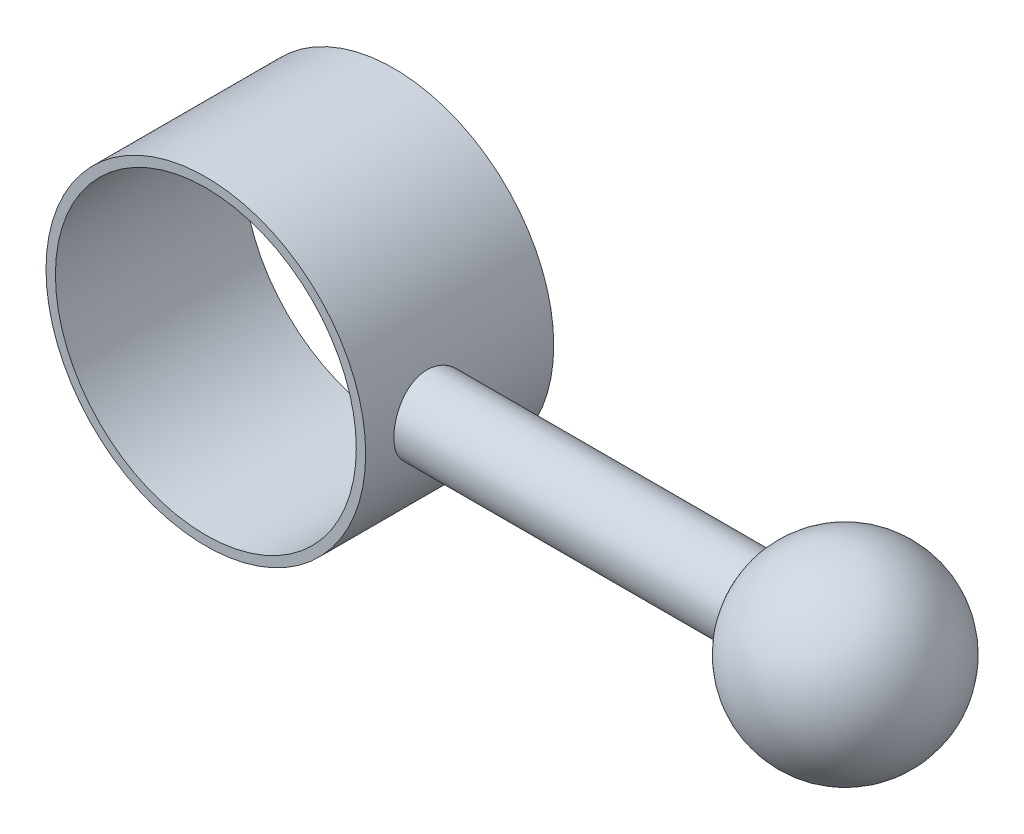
ISO-10303-21;
HEADER;
FILE_DESCRIPTION(('STEP AP214'),'2;1');
FILE_NAME('part.step','',(''),(''),'','','');
FILE_SCHEMA(('AUTOMOTIVE_DESIGN { 1 0 10303 214 1 1 1 1 }'));
ENDSEC;
DATA;
#1=APPLICATION_CONTEXT('core data for automotive mechanical design processes');
#2=APPLICATION_PROTOCOL_DEFINITION('international standard','automotive_design',2000,#1);
#3=PRODUCT_CONTEXT('',#1,'mechanical');
#4=PRODUCT('Part','Part','',(#3));
#5=PRODUCT_RELATED_PRODUCT_CATEGORY('part','',(#4));
#6=PRODUCT_DEFINITION_FORMATION('','',#4);
#7=PRODUCT_DEFINITION_CONTEXT('part definition',#1,'design');
#8=PRODUCT_DEFINITION('design','',#6,#7);
#9=PRODUCT_DEFINITION_SHAPE('','',#8);
#10=(LENGTH_UNIT() NAMED_UNIT(*) SI_UNIT(.MILLI.,.METRE.));
#11=(NAMED_UNIT(*) PLANE_ANGLE_UNIT() SI_UNIT($,.RADIAN.));
#12=(NAMED_UNIT(*) SI_UNIT($,.STERADIAN.) SOLID_ANGLE_UNIT());
#13=UNCERTAINTY_MEASURE_WITH_UNIT(LENGTH_MEASURE(1.E-05),#10,'distance_accuracy_value','');
#14=(GEOMETRIC_REPRESENTATION_CONTEXT(3) GLOBAL_UNCERTAINTY_ASSIGNED_CONTEXT((#13)) GLOBAL_UNIT_ASSIGNED_CONTEXT((#10,
#11,#12)) REPRESENTATION_CONTEXT('',''));
#15=CARTESIAN_POINT('',(0.,0.,0.));
#16=DIRECTION('',(0.,0.,1.));
#17=DIRECTION('',(1.,0.,0.));
#18=AXIS2_PLACEMENT_3D('',#15,#16,#17);
#19=CARTESIAN_POINT('',(0.,0.,0.));
#20=DIRECTION('',(0.,0.,-1.));
#21=DIRECTION('',(1.,0.,0.));
#22=AXIS2_PLACEMENT_3D('',#19,#20,#21);
#23=PLANE('',#22);
#24=CARTESIAN_POINT('',(0.,0.,0.));
#25=DIRECTION('',(0.,0.,-1.));
#26=DIRECTION('',(1.,0.,0.));
#27=AXIS2_PLACEMENT_3D('',#24,#25,#26);
#28=CIRCLE('',#27,17.);
#29=CARTESIAN_POINT('',(17.,0.,0.));
#30=VERTEX_POINT('',#29);
#31=EDGE_CURVE('E17',#30,#30,#28,.T.);
#32=ORIENTED_EDGE('',*,*,#31,.T.);
#33=EDGE_LOOP('',(#32));
#34=FACE_BOUND('',#33,.T.);
#35=CARTESIAN_POINT('',(0.,0.,0.));
#36=DIRECTION('',(0.,0.,-1.));
#37=DIRECTION('',(1.,0.,0.));
#38=AXIS2_PLACEMENT_3D('',#35,#36,#37);
#39=CIRCLE('',#38,16.);
#40=CARTESIAN_POINT('',(16.,0.,0.));
#41=VERTEX_POINT('',#40);
#42=EDGE_CURVE('E64',#41,#41,#39,.T.);
#43=ORIENTED_EDGE('',*,*,#42,.F.);
#44=EDGE_LOOP('',(#43));
#45=FACE_BOUND('',#44,.T.);
#46=ADVANCED_FACE('F12',(#34,#45),#23,.T.);
#47=CARTESIAN_POINT('',(0.,0.,0.));
#48=DIRECTION('',(0.,0.,1.));
#49=DIRECTION('',(-1.,0.,0.));
#50=AXIS2_PLACEMENT_3D('',#47,#48,#49);
#51=CYLINDRICAL_SURFACE('',#50,17.);
#52=CARTESIAN_POINT('',(0.,0.,20.));
#53=DIRECTION('',(0.,0.,-1.));
#54=DIRECTION('',(1.,0.,0.));
#55=AXIS2_PLACEMENT_3D('',#52,#53,#54);
#56=CIRCLE('',#55,17.);
#57=CARTESIAN_POINT('',(17.,0.,20.));
#58=VERTEX_POINT('',#57);
#59=EDGE_CURVE('E25',#58,#58,#56,.T.);
#60=ORIENTED_EDGE('',*,*,#59,.T.);
#61=EDGE_LOOP('',(#60));
#62=FACE_BOUND('',#61,.T.);
#63=ORIENTED_EDGE('',*,*,#31,.F.);
#64=EDGE_LOOP('',(#63));
#65=FACE_BOUND('',#64,.T.);
#66=CARTESIAN_POINT('',(16.9999999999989,5.83635432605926E-06,9.));
#67=CARTESIAN_POINT('',(16.9999959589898,0.221420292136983,9.00000691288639));
#68=CARTESIAN_POINT('',(16.9956306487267,0.442914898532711,9.01844610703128));
#69=CARTESIAN_POINT('',(16.9786390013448,0.879583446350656,9.09162175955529));
#70=CARTESIAN_POINT('',(16.9660073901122,1.09475326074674,9.14638139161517));
#71=CARTESIAN_POINT('',(16.9338856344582,1.5124009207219,9.29036481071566));
#72=CARTESIAN_POINT('',(16.9144032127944,1.71489275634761,9.37954980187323));
#73=CARTESIAN_POINT('',(16.870668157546,2.10203696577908,9.589722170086));
#74=CARTESIAN_POINT('',(16.8464154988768,2.28668924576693,9.71070971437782));
#75=CARTESIAN_POINT('',(16.7952856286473,2.63631339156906,9.98340628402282));
#76=CARTESIAN_POINT('',(16.7683717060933,2.80091013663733,10.1355894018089));
#77=CARTESIAN_POINT('',(16.7152036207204,3.10249425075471,10.4653408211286));
#78=CARTESIAN_POINT('',(16.688949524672,3.23947883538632,10.6429116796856));
#79=CARTESIAN_POINT('',(16.6397077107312,3.48366111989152,11.0212430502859));
#80=CARTESIAN_POINT('',(16.6167668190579,3.59044906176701,11.2222746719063));
#81=CARTESIAN_POINT('',(16.5772803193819,3.76857496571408,11.6400610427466));
#82=CARTESIAN_POINT('',(16.5607338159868,3.83991789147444,11.8568135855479));
#83=CARTESIAN_POINT('',(16.536285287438,3.94386822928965,12.2957904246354));
#84=CARTESIAN_POINT('',(16.5282340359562,3.97714521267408,12.5178476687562));
#85=CARTESIAN_POINT('',(16.5212402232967,4.0061029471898,12.9645277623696));
#86=CARTESIAN_POINT('',(16.5222963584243,4.00178907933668,13.1891502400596));
#87=CARTESIAN_POINT('',(16.5332633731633,3.95622401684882,13.6295288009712));
#88=CARTESIAN_POINT('',(16.5429853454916,3.91576080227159,13.845371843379));
#89=CARTESIAN_POINT('',(16.5698887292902,3.80029846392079,14.2671171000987));
#90=CARTESIAN_POINT('',(16.5870706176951,3.72529713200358,14.4730186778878));
#91=CARTESIAN_POINT('',(16.6271374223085,3.54219102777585,14.8711986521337));
#92=CARTESIAN_POINT('',(16.65007267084,3.43379206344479,15.0633364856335));
#93=CARTESIAN_POINT('',(16.6990323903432,3.18717400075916,15.4269823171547));
#94=CARTESIAN_POINT('',(16.7250573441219,3.04895023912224,15.5984870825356));
#95=CARTESIAN_POINT('',(16.7780669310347,2.74248101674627,15.9205245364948));
#96=CARTESIAN_POINT('',(16.8050592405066,2.57356805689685,16.0704214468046));
#97=CARTESIAN_POINT('',(16.8563692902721,2.21268614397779,16.3398735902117));
#98=CARTESIAN_POINT('',(16.8806869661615,2.02071663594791,16.4594280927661));
#99=CARTESIAN_POINT('',(16.924007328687,1.6183276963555,16.6649976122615));
#100=CARTESIAN_POINT('',(16.9429951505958,1.40785877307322,16.7509190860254));
#101=CARTESIAN_POINT('',(16.9734073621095,0.97492124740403,16.8859922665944));
#102=CARTESIAN_POINT('',(16.9848330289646,0.7524546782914,16.9351501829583));
#103=CARTESIAN_POINT('',(16.9986480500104,0.307281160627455,16.9943524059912));
#104=CARTESIAN_POINT('',(17.0012376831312,0.084695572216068,17.0052637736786));
#105=CARTESIAN_POINT('',(16.9976548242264,-0.359119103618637,16.9900276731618));
#106=CARTESIAN_POINT('',(16.9914830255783,-0.5803482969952,16.9638831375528));
#107=CARTESIAN_POINT('',(16.9711981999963,-1.01222533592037,16.8759944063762));
#108=CARTESIAN_POINT('',(16.9571887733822,-1.222972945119,16.8147143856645));
#109=CARTESIAN_POINT('',(16.9228014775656,-1.63119253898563,16.6588170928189));
#110=CARTESIAN_POINT('',(16.9024230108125,-1.82866327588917,16.5641966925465));
#111=CARTESIAN_POINT('',(16.8570708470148,-2.20823962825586,16.3425632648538));
#112=CARTESIAN_POINT('',(16.8320284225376,-2.39004653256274,16.2150530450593));
#113=CARTESIAN_POINT('',(16.7802491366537,-2.72999226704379,15.9319041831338));
#114=CARTESIAN_POINT('',(16.7535120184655,-2.88812749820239,15.7762612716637));
#115=CARTESIAN_POINT('',(16.7006497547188,-3.17974462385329,15.4372604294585));
#116=CARTESIAN_POINT('',(16.6745502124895,-3.31262182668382,15.2533775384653));
#117=CARTESIAN_POINT('',(16.6265685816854,-3.54562044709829,14.8654029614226));
#118=CARTESIAN_POINT('',(16.6046863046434,-3.64574332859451,14.6613121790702));
#119=CARTESIAN_POINT('',(16.5678444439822,-3.80967104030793,14.2398297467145));
#120=CARTESIAN_POINT('',(16.552844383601,-3.87368874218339,14.0225246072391));
#121=CARTESIAN_POINT('',(16.5314077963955,-3.96418454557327,13.5798359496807));
#122=CARTESIAN_POINT('',(16.5249696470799,-3.99066975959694,13.3544539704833));
#123=CARTESIAN_POINT('',(16.5214992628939,-4.0050098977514,12.9081340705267));
#124=CARTESIAN_POINT('',(16.5242326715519,-3.99382730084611,12.6872283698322));
#125=CARTESIAN_POINT('',(16.5382613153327,-3.93532721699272,12.2505458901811));
#126=CARTESIAN_POINT('',(16.5495564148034,-3.88801030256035,12.0347690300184));
#127=CARTESIAN_POINT('',(16.5793129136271,-3.75908179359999,11.6153788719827));
#128=CARTESIAN_POINT('',(16.5977406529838,-3.67763113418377,11.4117135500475));
#129=CARTESIAN_POINT('',(16.6396946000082,-3.48287847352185,11.0208034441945));
#130=CARTESIAN_POINT('',(16.6632214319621,-3.36957257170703,10.8335606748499));
#131=CARTESIAN_POINT('',(16.7134064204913,-3.11122368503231,10.4761137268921));
#132=CARTESIAN_POINT('',(16.7401246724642,-2.9655039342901,10.306407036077));
#133=CARTESIAN_POINT('',(16.7933022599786,-2.64780864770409,9.99354113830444));
#134=CARTESIAN_POINT('',(16.8197615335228,-2.47582698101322,9.85038814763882));
#135=CARTESIAN_POINT('',(16.8699292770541,-2.10726586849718,9.59254200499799));
#136=CARTESIAN_POINT('',(16.8935886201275,-1.91034576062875,9.47832559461));
#137=CARTESIAN_POINT('',(16.9349859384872,-1.49957265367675,9.28479822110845));
#138=CARTESIAN_POINT('',(16.9527285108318,-1.28573296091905,9.2054601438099));
#139=CARTESIAN_POINT('',(16.9774034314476,-0.893307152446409,9.09687921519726));
#140=CARTESIAN_POINT('',(16.985821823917,-0.716721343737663,9.06062344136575));
#141=CARTESIAN_POINT('',(16.997121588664,-0.360105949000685,9.01218173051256));
#142=CARTESIAN_POINT('',(17.0000032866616,-0.180076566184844,8.99999437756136));
#143=CARTESIAN_POINT('',(16.9999999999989,5.83635432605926E-06,9.));
#144=B_SPLINE_CURVE_WITH_KNOTS('',3,(#66,#67,#68,#69,#70,#71,#72,#73,#74,#75,#76,#77,#78,#79,
#80,#81,#82,#83,#84,#85,#86,#87,#88,#89,#90,#91,#92,#93,#94,#95,#96,#97,#98,#99,#100,#101,#102,
#103,#104,#105,#106,#107,#108,#109,#110,#111,#112,#113,#114,#115,#116,#117,#118,#119,#120,#121,
#122,#123,#124,#125,#126,#127,#128,#129,#130,#131,#132,#133,#134,#135,#136,#137,#138,#139,#140,
#141,#142,#143),.UNSPECIFIED.,.T.,.F.,(4,2,2,2,2,2,2,2,2,2,2,2,2,2,2,2,2,2,2,2,2,2,2,2,2,2,2,2,
2,2,2,2,2,2,2,2,2,2,4),(0.,0.66358380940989,1.32759141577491,1.99085288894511,2.65411785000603,
3.32832983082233,4.0026097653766,4.68564276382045,5.36858008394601,6.0393104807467,
6.70994486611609,7.36630814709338,8.02271339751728,8.6850745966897,9.34753943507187,
10.0266619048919,10.7058007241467,11.3868152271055,12.0677146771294,12.7330743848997,
13.3983814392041,14.0550952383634,14.7118706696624,15.3792246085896,16.0466799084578,
16.7285183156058,17.4103262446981,18.0880711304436,18.7656875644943,19.4261224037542,
20.0865467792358,20.7438917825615,21.4013173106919,22.0740311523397,22.7469022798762,
23.4302278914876,24.1130213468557,24.6527638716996,25.1924746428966),.UNSPECIFIED.);
#145=CARTESIAN_POINT('',(16.9999999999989,5.83635432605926E-06,9.));
#146=VERTEX_POINT('',#145);
#147=EDGE_CURVE('E8',#146,#146,#144,.T.);
#148=ORIENTED_EDGE('',*,*,#147,.F.);
#149=EDGE_LOOP('',(#148));
#150=FACE_BOUND('',#149,.T.);
#151=ADVANCED_FACE('F14',(#62,#65,#150),#51,.T.);
#152=CARTESIAN_POINT('',(0.,0.,20.));
#153=DIRECTION('',(0.,0.,-1.));
#154=DIRECTION('',(1.,0.,0.));
#155=AXIS2_PLACEMENT_3D('',#152,#153,#154);
#156=PLANE('',#155);
#157=ORIENTED_EDGE('',*,*,#59,.F.);
#158=EDGE_LOOP('',(#157));
#159=FACE_BOUND('',#158,.T.);
#160=CARTESIAN_POINT('',(0.,0.,20.));
#161=DIRECTION('',(0.,0.,-1.));
#162=DIRECTION('',(1.,0.,0.));
#163=AXIS2_PLACEMENT_3D('',#160,#161,#162);
#164=CIRCLE('',#163,16.);
#165=CARTESIAN_POINT('',(16.,0.,20.));
#166=VERTEX_POINT('',#165);
#167=EDGE_CURVE('E34',#166,#166,#164,.T.);
#168=ORIENTED_EDGE('',*,*,#167,.T.);
#169=EDGE_LOOP('',(#168));
#170=FACE_BOUND('',#169,.T.);
#171=ADVANCED_FACE('F48',(#159,#170),#156,.F.);
#172=CARTESIAN_POINT('',(0.,0.,0.));
#173=DIRECTION('',(0.,0.,1.));
#174=DIRECTION('',(-1.,0.,0.));
#175=AXIS2_PLACEMENT_3D('',#172,#173,#174);
#176=CYLINDRICAL_SURFACE('',#175,16.);
#177=ORIENTED_EDGE('',*,*,#167,.F.);
#178=EDGE_LOOP('',(#177));
#179=FACE_BOUND('',#178,.T.);
#180=ORIENTED_EDGE('',*,*,#42,.T.);
#181=EDGE_LOOP('',(#180));
#182=FACE_BOUND('',#181,.T.);
#183=ADVANCED_FACE('F42',(#179,#182),#176,.F.);
#184=CARTESIAN_POINT('',(2.,5.8363543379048E-06,13.));
#185=DIRECTION('',(1.,0.,0.));
#186=DIRECTION('',(0.,0.,-1.));
#187=AXIS2_PLACEMENT_3D('',#184,#185,#186);
#188=CYLINDRICAL_SURFACE('',#187,4.);
#189=CARTESIAN_POINT('',(52.,5.83635433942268E-06,13.));
#190=DIRECTION('',(-1.,0.,0.));
#191=DIRECTION('',(0.,0.,1.));
#192=AXIS2_PLACEMENT_3D('',#189,#190,#191);
#193=CIRCLE('',#192,4.);
#194=CARTESIAN_POINT('',(52.,5.83635433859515E-06,17.));
#195=VERTEX_POINT('',#194);
#196=EDGE_CURVE('E32',#195,#195,#193,.T.);
#197=ORIENTED_EDGE('',*,*,#196,.T.);
#198=EDGE_LOOP('',(#197));
#199=FACE_BOUND('',#198,.T.);
#200=ORIENTED_EDGE('',*,*,#147,.T.);
#201=EDGE_LOOP('',(#200));
#202=FACE_BOUND('',#201,.T.);
#203=ADVANCED_FACE('F36',(#199,#202),#188,.T.);
#204=CARTESIAN_POINT('',(61.,5.83635428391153E-06,13.));
#205=DIRECTION('',(0.,0.056125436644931,0.998423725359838));
#206=DIRECTION('',(0.,-0.998423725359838,0.056125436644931));
#207=AXIS2_PLACEMENT_3D('',#204,#205,#206);
#208=SPHERICAL_SURFACE('',#207,9.99999997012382);
#209=CARTESIAN_POINT('',(61.,5.83635428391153E-06,13.));
#210=DIRECTION('',(-1.,0.,0.));
#211=DIRECTION('',(0.,-0.056125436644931,-0.998423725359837));
#212=AXIS2_PLACEMENT_3D('',#209,#210,#211);
#213=SPHERICAL_SURFACE('',#212,9.99999997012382);
#214=CARTESIAN_POINT('',(52.,5.83635427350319E-06,13.));
#215=DIRECTION('',(-1.,0.,0.));
#216=DIRECTION('',(0.,-0.056125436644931,-0.998423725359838));
#217=AXIS2_PLACEMENT_3D('',#214,#215,#216);
#218=CIRCLE('',#217,4.358899);
#219=CARTESIAN_POINT('',(52.,-0.24463927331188,8.64797182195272));
#220=VERTEX_POINT('',#219);
#221=EDGE_CURVE('E71',#220,#220,#218,.T.);
#222=ORIENTED_EDGE('',*,*,#221,.F.);
#223=EDGE_LOOP('',(#222));
#224=FACE_BOUND('',#223,.T.);
#225=ADVANCED_FACE('F41',(#224),#213,.T.);
#226=CARTESIAN_POINT('',(52.,4.35203401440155,12.7553548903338));
#227=DIRECTION('',(1.,0.,0.));
#228=DIRECTION('',(0.,0.056125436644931,0.998423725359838));
#229=AXIS2_PLACEMENT_3D('',#226,#227,#228);
#230=PLANE('',#229);
#231=ORIENTED_EDGE('',*,*,#196,.F.);
#232=EDGE_LOOP('',(#231));
#233=FACE_BOUND('',#232,.T.);
#234=ORIENTED_EDGE('',*,*,#221,.T.);
#235=EDGE_LOOP('',(#234));
#236=FACE_BOUND('',#235,.T.);
#237=ADVANCED_FACE('F44',(#233,#236),#230,.F.);
#238=CLOSED_SHELL('',(#46,#151,#171,#183,#203,#225,#237));
#239=MANIFOLD_SOLID_BREP('B1',#238);
#240=ADVANCED_BREP_SHAPE_REPRESENTATION('',(#18,#239),#14);
#241=SHAPE_DEFINITION_REPRESENTATION(#9,#240);
ENDSEC;
END-ISO-10303-21;
